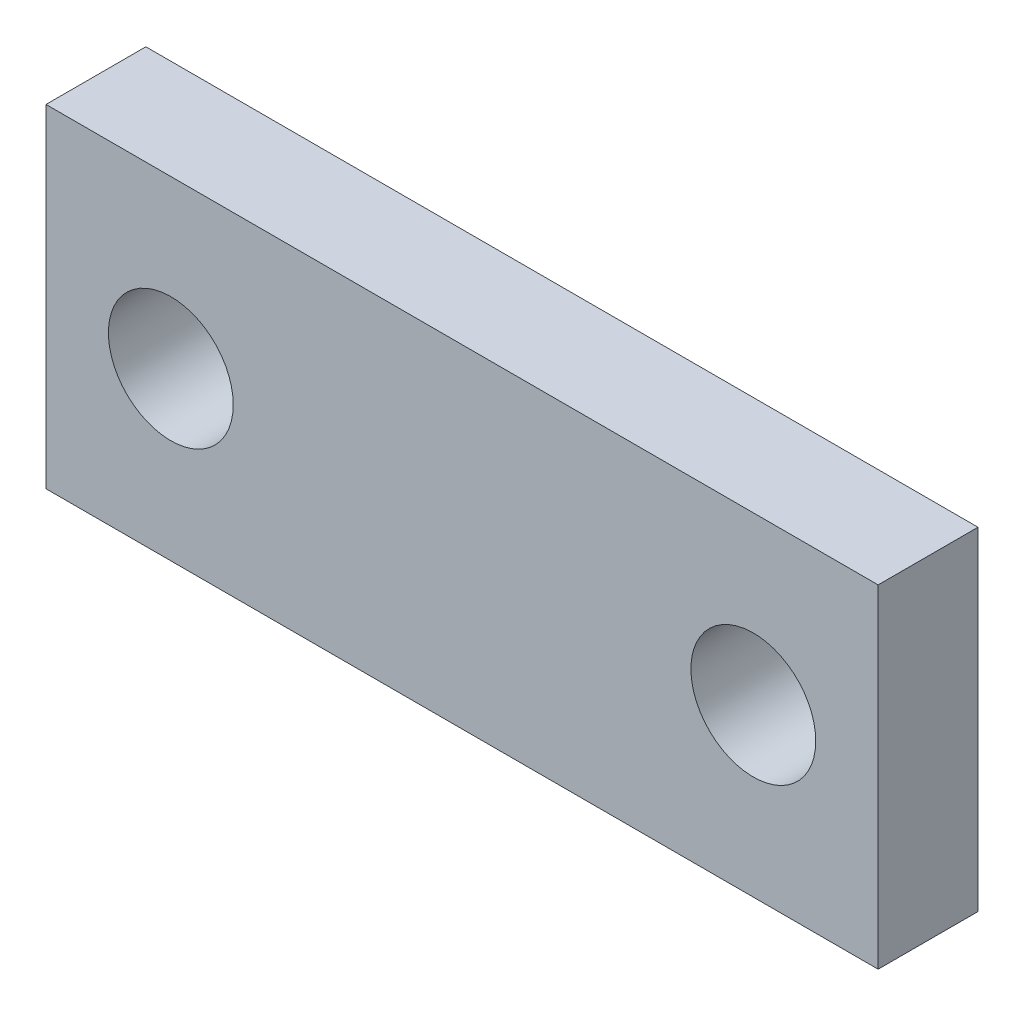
from build123d import *

# Parameters (mm, degrees)
SKETCH1_W          = 31.75
SKETCH1_H          = 12.7
EXTRUDE2_DEPTH     = 3.81
SKETCH3_R          = 2.38125
CUT_EXTRUDE1_DEPTH = 3.81


with BuildPart() as part:
    # Sketch1 → Extrude2 (new body)
    with BuildSketch(Plane.XY):
        with Locations((-4.047103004, -3.070529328)):
            Rectangle(SKETCH1_W, SKETCH1_H)
    extrude(amount=EXTRUDE2_DEPTH)

    # Sketch3 → Cut-Extrude1 (cut)
    with BuildSketch(Plane.XY.offset(3.81)):
        with Locations((-15.159603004, -3.070529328)):
            Circle(SKETCH3_R)
        with Locations((7.065396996, -3.070529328)):
            Circle(SKETCH3_R)
    extrude(amount=-CUT_EXTRUDE1_DEPTH, mode=Mode.SUBTRACT)


solid = part.part
